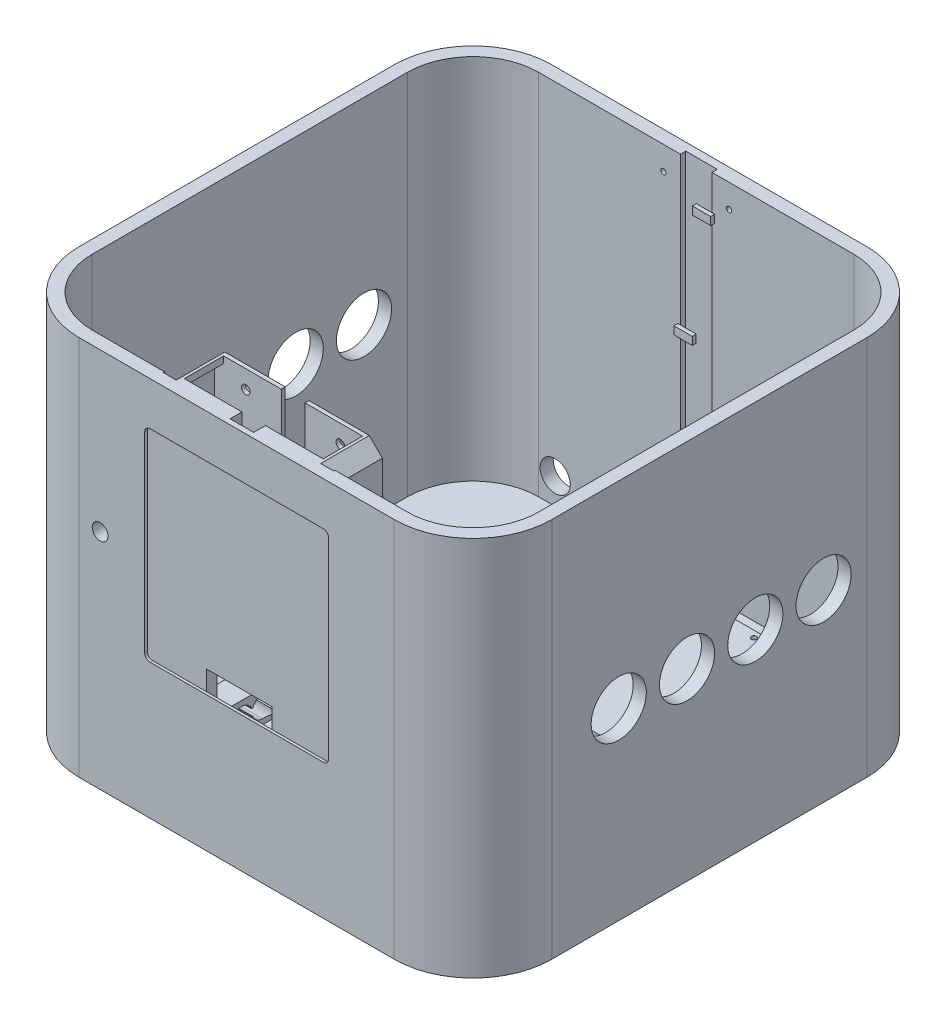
from build123d import *

# Parameters (mm, degrees)
SKETCH_1_W               = 180
SKETCH_1_H               = 180
EXTRUDE_1_DEPTH          = 180
FILLET_1_R               = 30
SHEET_EXTRUDE_1_1_BACK   = 154
SHEET_EXTRUDE_1_1_DEPTH  = 308
SHELL_2_T                = -5
SKETCH_3_W               = 13
SKETCH_3_H               = 25
EXTRUDE_2_DEPTH          = 3.5
CUT_EXTRUDE_1_REACH      = 188.634
SKETCH_4_R               = 2.75
CUT_EXTRUDE_2_DEPTH      = 4
SKETCH_7_W               = 53
SKETCH_7_H               = 63.904844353
EXTRUDE_3_DEPTH          = 2
CUT_EXTRUDE_6_DEPTH      = 2
CUT_EXTRUDE_6_DEPTH_BACK = 3
SKETCH_6_R               = 1
SKETCH_8_W               = 13
SKETCH_8_H               = 2.5
CUT_EXTRUDE_7_DEPTH      = 3.5
SKETCH_9_W               = 38
SKETCH_9_H               = 35
EXTRUDE_5_DEPTH          = 2
SKETCH_10_R              = 1
CUT_EXTRUDE_8_DEPTH      = 5
SKETCH_11_W              = 33
SKETCH_11_H              = 38
EXTRUDE_6_DEPTH          = 2
SKETCH_12_R              = 1
CUT_EXTRUDE_9_DEPTH      = 5
SKETCH_13_W              = 32
SKETCH_13_H              = 36
EXTRUDE_7_DEPTH          = 2
SKETCH_14_R              = 1
CUT_EXTRUDE_10_DEPTH     = 5
SKETCH_15_W              = 65
SKETCH_15_H              = 75
EXTRUDE_9_DEPTH          = 18
CUT_EXTRUDE_11_DEPTH     = 9.5
CUT_EXTRUDE_12_DEPTH     = 7.5
CUT_EXTRUDE_13_DEPTH     = 2.5
SKETCH_20_R              = 1.65
CUT_EXTRUDE_17_DEPTH     = 2
SKETCH_22_W              = 70
SKETCH_22_H              = 77
CUT_EXTRUDE_18_DEPTH     = 1
CUT_EXTRUDE_19_REACH     = 249.318
SKETCH_23_W              = 25
SKETCH_23_H              = 5
CUT_EXTRUDE_20_REACH     = 250.042
SKETCH_24_R              = 1
CUT_EXTRUDE_21_REACH     = 250.042
SKETCH_25_R              = 5.75
CUT_EXTRUDE_22_REACH     = 250.042
SKETCH_26_R              = 10.5
CUT_EXTRUDE_START        = -49
SKETCH_27_W              = 25
SKETCH_27_H              = 4
CUT_EXTRUDE_23_DEPTH     = 49
CUT_EXTRUDE_START_2      = -140
SKETCH_28_W              = 12
SKETCH_28_H              = 2
CUT_EXTRUDE_24_DEPTH     = 140
CUT_EXTRUDE_25_REACH     = 250.042
SKETCH_29_R              = 3
SKETCH_30_W              = 9
SKETCH_30_H              = 21
CUT_EXTRUDE_26_DEPTH     = 25
FILLET_2_R               = 2
SKETCH_31_W              = 7
SKETCH_31_H              = 3
EXTRUDE_10_DEPTH         = 1.5
SKETCH_32_W              = 8.454545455
SKETCH_32_H              = 6
SKETCH_32_W_2            = 11
SKETCH_32_H_2            = 11
SKETCH_32_W_3            = 7
SKETCH_32_H_3            = 7
EXTRUDE_11_DEPTH         = 5.5
SKETCH_33_R              = 1
CUT_EXTRUDE_27_DEPTH     = 8
SKETCH_35_W              = 5.5
SKETCH_35_H              = 5.5
CUT_EXTRUDE_28_DEPTH     = 3
SKETCH_36_W              = 7.5
SKETCH_36_H              = 12
CUT_EXTRUDE_29_DEPTH     = 2.5
SKETCH_37_W              = 10
SKETCH_37_H              = 22
EXTRUDE_12_DEPTH         = 12
CUT_EXTRUDE_30_DEPTH     = 56.5


with BuildPart() as part:
    # Sketch 1 → Extrude 1 (new body)
    with BuildSketch(Plane(origin=(0, 0, 0), x_dir=(1, 0, 0), z_dir=(0, 1, 0))):
        Rectangle(SKETCH_1_W, SKETCH_1_H)
    extrude(amount=EXTRUDE_1_DEPTH)

    # Fillet 1
    fillet_1_edges = [part.edges().sort_by_distance(p)[0] for p in [
        (90, 90, 90),
        (-90, 90, 90),
        (-90, 90, -90),
        (90, 90, -90),
    ]]
    fillet(fillet_1_edges, radius=FILLET_1_R)

    # Surface Cut 1: cut with a surface, the side behind it stays
    # Sheet Extrude 1: a surface, the sketch's curves swept straight by 308 mm
    with BuildLine(Plane(origin=(0, 0, 0), x_dir=(0, 0, -1), z_dir=(1, 0, 0)).offset(-SHEET_EXTRUDE_1_1_BACK), mode=Mode.PRIVATE) as sheet_extrude_1_1_path:
        Line((-111.469937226, 145), (109.067567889, 145))
    sheet_extrude_1_1 = Shell.extrude(sheet_extrude_1_1_path.wire(), (1 * SHEET_EXTRUDE_1_1_DEPTH, 0 * SHEET_EXTRUDE_1_1_DEPTH, 0 * SHEET_EXTRUDE_1_1_DEPTH))
    split(bisect_by=sheet_extrude_1_1, keep=Keep.BOTTOM)

    # Shell 2
    shell_2_openings = [part.faces().sort_by_distance(p)[0] for p in [
        (0, 145, 0),
    ]]
    offset(amount=SHELL_2_T, openings=shell_2_openings, kind=Kind.INTERSECTION)

    # Sketch 3 → Extrude 2 (add)
    with BuildSketch(Plane(origin=(0, 5, 0), x_dir=(1, 0, 0), z_dir=(0, 1, 0))):
        with Locations((0, 72.5)):
            Rectangle(SKETCH_3_W, SKETCH_3_H)
    extrude(amount=EXTRUDE_2_DEPTH)

    # Sketch 4 → Cut-Extrude 1 (cut, up to next)
    with BuildSketch(Plane(origin=(0, 8.5, 0), x_dir=(1, 0, 0), z_dir=(0, 1, 0)), mode=Mode.PRIVATE) as cut_extrude_1_sk1:
        with Locations(Location((0, 79.5, 0), (0, 0, 270))):
            Circle(SKETCH_4_R)
    cut_extrude_1_tool1 = extrude(cut_extrude_1_sk1.sketch, amount=-CUT_EXTRUDE_1_REACH, mode=Mode.PRIVATE) & part.part
    # Sketch 4 → Cut-Extrude 1 (cut, up to next)
    with BuildSketch(Plane(origin=(0, 8.5, 0), x_dir=(1, 0, 0), z_dir=(0, 1, 0)), mode=Mode.PRIVATE) as cut_extrude_1_sk2:
        with Locations(Location((0, 64.5, 0), (0, 0, 270))):
            Circle(SKETCH_4_R)
    cut_extrude_1_tool2 = extrude(cut_extrude_1_sk2.sketch, amount=-CUT_EXTRUDE_1_REACH, mode=Mode.PRIVATE) & part.part
    add(cut_extrude_1_tool1.solids().sort_by_distance((0, 8.5, -79.5))[0], mode=Mode.SUBTRACT)
    add(cut_extrude_1_tool2.solids().sort_by_distance((0, 8.5, -64.5))[0], mode=Mode.SUBTRACT)

    # Sketch 5 → Cut-Extrude 2 (cut)
    with BuildSketch(Plane.XZ):
        Polygon((4.330127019, -67), (4.330127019, -62), (0, -59.5), (-4.330127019, -62), (-4.330127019, -67), (0, -69.5), align=None)
        Polygon((4.330127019, -82), (4.330127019, -77), (0, -74.5), (-4.330127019, -77), (-4.330127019, -82), (0, -84.5), align=None)
    extrude(amount=-CUT_EXTRUDE_2_DEPTH, mode=Mode.SUBTRACT)

    # Sketch 7 → Extrude 3 (add)
    with BuildSketch(Plane(origin=(0, 5, 0), x_dir=(1, 0, 0), z_dir=(0, 1, 0))):
        with Locations((38, 48.047577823)):
            Rectangle(SKETCH_7_W, SKETCH_7_H)
    extrude(amount=EXTRUDE_3_DEPTH)

    # Sketch 6 → Cut-Extrude 6 (cut, two sides: drawn at the far end of the back side and taken through both)
    with BuildSketch(Plane(origin=(0, 5, 0), x_dir=(1, 0, 0), z_dir=(0, 1, 0)).offset(-CUT_EXTRUDE_6_DEPTH_BACK)):
        with Locations(Location((29.5, 77.5, 0), (0, 0, 270))):
            Circle(SKETCH_6_R)
        with Locations(Location((57, 77.5, 0), (0, 0, 270))):
            Circle(SKETCH_6_R)
        with Locations(Location((62, 25, 0), (0, 0, 270))):
            Circle(SKETCH_6_R)
    extrude(amount=CUT_EXTRUDE_6_DEPTH + CUT_EXTRUDE_6_DEPTH_BACK, mode=Mode.SUBTRACT)

    # Sketch 8 → Cut-Extrude 7 (cut)
    with BuildSketch(Plane(origin=(0, 8.5, 0), x_dir=(1, 0, 0), z_dir=(0, 1, 0))):
        with Locations((0, 83.75)):
            Rectangle(SKETCH_8_W, SKETCH_8_H)
    extrude(amount=-CUT_EXTRUDE_7_DEPTH, mode=Mode.SUBTRACT)

    # Sketch 9 → Extrude 5 (add)
    with BuildSketch(Plane(origin=(0, 5, 0), x_dir=(1, 0, 0), z_dir=(0, 1, 0))):
        with Locations((-30.5, 62.5)):
            Rectangle(SKETCH_9_W, SKETCH_9_H)
    extrude(amount=EXTRUDE_5_DEPTH)

    # Sketch 10 → Cut-Extrude 8 (cut)
    with BuildSketch(Plane(origin=(0, 7, 0), x_dir=(1, 0, 0), z_dir=(0, 1, 0))):
        with Locations(Location((-45.5, 75, 0), (0, 0, 270))):
            Circle(SKETCH_10_R)
        with Locations(Location((-15.5, 75, 0), (0, 0, 270))):
            Circle(SKETCH_10_R)
        with Locations(Location((-45.5, 50, 0), (0, 0, 270))):
            Circle(SKETCH_10_R)
        with Locations(Location((-15.5, 50, 0), (0, 0, 270))):
            Circle(SKETCH_10_R)
    extrude(amount=-CUT_EXTRUDE_8_DEPTH, mode=Mode.SUBTRACT)

    # Sketch 11 → Extrude 6 (add)
    with BuildSketch(Plane(origin=(0, 5, 0), x_dir=(1, 0, 0), z_dir=(0, 1, 0))):
        with Locations((-28, 21)):
            Rectangle(SKETCH_11_W, SKETCH_11_H)
    extrude(amount=EXTRUDE_6_DEPTH)

    # Sketch 12 → Cut-Extrude 9 (cut)
    with BuildSketch(Plane(origin=(0, 7, 0), x_dir=(1, 0, 0), z_dir=(0, 1, 0))):
        with Locations(Location((-40.5, 36, 0), (0, 0, 270))):
            Circle(SKETCH_12_R)
        with Locations(Location((-15.5, 36, 0), (0, 0, 270))):
            Circle(SKETCH_12_R)
        with Locations(Location((-15.5, 6, 0), (0, 0, 270))):
            Circle(SKETCH_12_R)
        with Locations(Location((-40.5, 6, 0), (0, 0, 270))):
            Circle(SKETCH_12_R)
    extrude(amount=-CUT_EXTRUDE_9_DEPTH, mode=Mode.SUBTRACT)

    # Sketch 13 → Extrude 7 (add)
    with BuildSketch(Plane(origin=(0, 5, 0), x_dir=(1, 0, 0), z_dir=(0, 1, 0))):
        with Locations((-65.5, 22)):
            Rectangle(SKETCH_13_W, SKETCH_13_H)
    extrude(amount=EXTRUDE_7_DEPTH)

    # Sketch 14 → Cut-Extrude 10 (cut)
    with BuildSketch(Plane(origin=(0, 7, 0), x_dir=(1, 0, 0), z_dir=(0, 1, 0))):
        with Locations(Location((-78, 36, 0), (0, 0, 270))):
            Circle(SKETCH_14_R)
        with Locations(Location((-53, 36, 0), (0, 0, 270))):
            Circle(SKETCH_14_R)
    extrude(amount=-CUT_EXTRUDE_10_DEPTH, mode=Mode.SUBTRACT)

    # Sketch 15 → Extrude 9 (add)
    with BuildSketch(Plane(origin=(0, 0, 85), x_dir=(-1, 0, 0), z_dir=(0, 0, -1))):
        with Locations((0, 107.5)):
            Rectangle(SKETCH_15_W, SKETCH_15_H)
    extrude(amount=EXTRUDE_9_DEPTH)

    # Sketch 17 → Cut-Extrude 11 (cut, symmetric)
    with BuildSketch(Plane(origin=(0, 0, 76), x_dir=(-1, 0, 0), z_dir=(0, 0, -1))):
        Polygon((-32.5, 145), (-32.5, 140), (-27.5, 145), align=None)
    cut_extrude_11 = extrude(amount=CUT_EXTRUDE_11_DEPTH, both=True, mode=Mode.SUBTRACT)

    # Mirror 1: Cut-Extrude 11 across plane
    add(cut_extrude_11.mirror(Plane(origin=(0, 0, 0), x_dir=(0, 0, 1), z_dir=(1, 0, 0))), mode=Mode.SUBTRACT)

    # Sketch 18 → Cut-Extrude 12 (cut, symmetric)
    with BuildSketch(Plane(origin=(0, 0, 76), x_dir=(-1, 0, 0), z_dir=(0, 0, -1))):
        Polygon((-30, 138.964466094), (-26.464466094, 142.5), (-26.464466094, 145.02565997), (26.464466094, 145.02565997), (26.464466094, 142.5), (30, 138.964466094), (30, 72.5), (30, 69.952762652), (-30, 69.952762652), (-30, 72.5), align=None)
    extrude(amount=CUT_EXTRUDE_12_DEPTH, both=True, mode=Mode.SUBTRACT)

    # Sketch 19 → Cut-Extrude 13 (cut)
    with BuildSketch(Plane(origin=(0, 0, 83.5), x_dir=(-1, 0, 0), z_dir=(0, 0, -1))):
        Polygon((-15.055513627, 136.4), (-15.055513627, 139.8), (-18, 141.5), (-20.944486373, 139.8), (-20.944486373, 136.4), (-18, 134.7), align=None)
        Polygon((18, 134.7), (20.944486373, 136.4), (20.944486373, 139.8), (18, 141.5), (15.055513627, 139.8), (15.055513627, 136.4), align=None)
        Polygon((2.944486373, 100.6), (2.944486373, 104), (0, 105.7), (-2.944486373, 104), (-2.944486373, 100.6), (0, 98.9), align=None)
    extrude(amount=-CUT_EXTRUDE_13_DEPTH, mode=Mode.SUBTRACT)

    # Sketch 20 → Cut-Extrude 17 (cut)
    with BuildSketch(Plane(origin=(0, 0, 67), x_dir=(-1, 0, 0), z_dir=(0, 0, -1))):
        with Locations((-18, 138.1)):
            Circle(SKETCH_20_R)
        with Locations((18, 138.1)):
            Circle(SKETCH_20_R)
        with Locations((0, 102.3)):
            Circle(SKETCH_20_R)
    extrude(amount=-CUT_EXTRUDE_17_DEPTH, mode=Mode.SUBTRACT)

    # Sketch 22 → Cut-Extrude 18 (cut)
    with BuildSketch(Plane.XY.offset(90)):
        with Locations((0, 90)):
            Rectangle(SKETCH_22_W, SKETCH_22_H)
    extrude(amount=-CUT_EXTRUDE_18_DEPTH, mode=Mode.SUBTRACT)

    # Sketch 23 → Cut-Extrude 19 (cut, up to next)
    with BuildSketch(Plane.XY.offset(89), mode=Mode.PRIVATE) as cut_extrude_19_sk1:
        with Locations((0, 56.5)):
            Rectangle(SKETCH_23_W, SKETCH_23_H)
    cut_extrude_19_tool1 = extrude(cut_extrude_19_sk1.sketch, amount=-CUT_EXTRUDE_19_REACH, mode=Mode.PRIVATE) & part.part
    add(cut_extrude_19_tool1.solids().sort_by_distance((0, 56.5, 89))[0], mode=Mode.SUBTRACT)

    # Sketch 24 → Cut-Extrude 20 (cut, up to next)
    with BuildSketch(Plane(origin=(0, 0, -90), x_dir=(-1, 0, 0), z_dir=(0, 0, -1)), mode=Mode.PRIVATE) as cut_extrude_20_sk1:
        with Locations((-12.5, 136)):
            Circle(SKETCH_24_R)
    cut_extrude_20_tool1 = extrude(cut_extrude_20_sk1.sketch, amount=-CUT_EXTRUDE_20_REACH, mode=Mode.PRIVATE) & part.part
    # Sketch 24 → Cut-Extrude 20 (cut, up to next)
    with BuildSketch(Plane(origin=(0, 0, -90), x_dir=(-1, 0, 0), z_dir=(0, 0, -1)), mode=Mode.PRIVATE) as cut_extrude_20_sk2:
        with Locations((12.5, 136)):
            Circle(SKETCH_24_R)
    cut_extrude_20_tool2 = extrude(cut_extrude_20_sk2.sketch, amount=-CUT_EXTRUDE_20_REACH, mode=Mode.PRIVATE) & part.part
    add(cut_extrude_20_tool1.solids().sort_by_distance((12.5, 136, -90))[0], mode=Mode.SUBTRACT)
    add(cut_extrude_20_tool2.solids().sort_by_distance((-12.5, 136, -90))[0], mode=Mode.SUBTRACT)

    # Sketch 25 → Cut-Extrude 21 (cut, up to next)
    with BuildSketch(Plane(origin=(0, 0, -90), x_dir=(-1, 0, 0), z_dir=(0, 0, -1)), mode=Mode.PRIVATE) as cut_extrude_21_sk1:
        with Locations((53.699478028, 15)):
            Circle(SKETCH_25_R)
    cut_extrude_21_tool1 = extrude(cut_extrude_21_sk1.sketch, amount=-CUT_EXTRUDE_21_REACH, mode=Mode.PRIVATE) & part.part
    add(cut_extrude_21_tool1.solids().sort_by_distance((-53.699478, 15, -90))[0], mode=Mode.SUBTRACT)

    # Sketch 26 → Cut-Extrude 22 (cut, up to next)
    with BuildSketch(Plane.ZY.offset(90), mode=Mode.PRIVATE) as cut_extrude_22_sk1:
        with Locations((34.503472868, 70)):
            Circle(SKETCH_26_R)
    cut_extrude_22_tool1 = extrude(cut_extrude_22_sk1.sketch, amount=-CUT_EXTRUDE_22_REACH, mode=Mode.PRIVATE) & part.part
    # Sketch 26 → Cut-Extrude 22 (cut, up to next)
    with BuildSketch(Plane.ZY.offset(90), mode=Mode.PRIVATE) as cut_extrude_22_sk2:
        with Locations((8.503472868, 70)):
            Circle(SKETCH_26_R)
    cut_extrude_22_tool2 = extrude(cut_extrude_22_sk2.sketch, amount=-CUT_EXTRUDE_22_REACH, mode=Mode.PRIVATE) & part.part
    # Sketch 26 → Cut-Extrude 22 (cut, up to next)
    with BuildSketch(Plane.ZY.offset(90), mode=Mode.PRIVATE) as cut_extrude_22_sk3:
        with Locations((-17.496527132, 70)):
            Circle(SKETCH_26_R)
    cut_extrude_22_tool3 = extrude(cut_extrude_22_sk3.sketch, amount=-CUT_EXTRUDE_22_REACH, mode=Mode.PRIVATE) & part.part
    # Sketch 26 → Cut-Extrude 22 (cut, up to next)
    with BuildSketch(Plane.ZY.offset(90), mode=Mode.PRIVATE) as cut_extrude_22_sk4:
        with Locations((-43.496527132, 70)):
            Circle(SKETCH_26_R)
    cut_extrude_22_tool4 = extrude(cut_extrude_22_sk4.sketch, amount=-CUT_EXTRUDE_22_REACH, mode=Mode.PRIVATE) & part.part
    cut_extrude_22_1 = cut_extrude_22_tool1.solids().sort_by_distance((-90, 70, 34.503473))[0]
    add(cut_extrude_22_1, mode=Mode.SUBTRACT)
    cut_extrude_22_2 = cut_extrude_22_tool2.solids().sort_by_distance((-90, 70, 8.503473))[0]
    add(cut_extrude_22_2, mode=Mode.SUBTRACT)
    cut_extrude_22_3 = cut_extrude_22_tool3.solids().sort_by_distance((-90, 70, -17.496527))[0]
    add(cut_extrude_22_3, mode=Mode.SUBTRACT)
    cut_extrude_22_4 = cut_extrude_22_tool4.solids().sort_by_distance((-90, 70, -43.496527))[0]
    add(cut_extrude_22_4, mode=Mode.SUBTRACT)
    cut_extrude_22 = cut_extrude_22_1 + cut_extrude_22_2 + cut_extrude_22_3 + cut_extrude_22_4  # Cut-Extrude 22 as one shape, for the pattern or mirror that repeats it

    # Mirror 3: Cut-Extrude 22 across plane
    add(cut_extrude_22.mirror(Plane(origin=(0, 0, 0), x_dir=(0, 0, 1), z_dir=(1, 0, 0))), mode=Mode.SUBTRACT)

    # Sketch 27 → Cut-Extrude 23 (cut)
    with BuildSketch(Plane(origin=(0, 54, 0), x_dir=(1, 0, 0), z_dir=(0, 1, 0)).offset(CUT_EXTRUDE_START)):
        with Locations((0, -87)):
            Rectangle(SKETCH_27_W, SKETCH_27_H)
    extrude(amount=CUT_EXTRUDE_23_DEPTH, mode=Mode.SUBTRACT)

    # Sketch 28 → Cut-Extrude 24 (cut)
    with BuildSketch(Plane(origin=(0, 145, 0), x_dir=(1, 0, 0), z_dir=(0, 1, 0)).offset(CUT_EXTRUDE_START_2)):
        with Locations((0, 86)):
            Rectangle(SKETCH_28_W, SKETCH_28_H)
    extrude(amount=CUT_EXTRUDE_24_DEPTH, mode=Mode.SUBTRACT)

    # Sketch 29 → Cut-Extrude 25 (cut, up to next)
    with BuildSketch(Plane.XY.offset(90), mode=Mode.PRIVATE) as cut_extrude_25_sk1:
        with Locations((-52, 85)):
            Circle(SKETCH_29_R)
    cut_extrude_25_tool1 = extrude(cut_extrude_25_sk1.sketch, amount=-CUT_EXTRUDE_25_REACH, mode=Mode.PRIVATE) & part.part
    add(cut_extrude_25_tool1.solids().sort_by_distance((-52, 85, 90))[0], mode=Mode.SUBTRACT)

    # Sketch 30 → Cut-Extrude 26 (cut)
    with BuildSketch(Plane(origin=(0, 145, 0), x_dir=(1, 0, 0), z_dir=(0, 1, 0))):
        with Locations((0, -77.5)):
            Rectangle(SKETCH_30_W, SKETCH_30_H)
    extrude(amount=-CUT_EXTRUDE_26_DEPTH, mode=Mode.SUBTRACT)

    # Fillet 2
    fillet_2_edges = [part.edges().sort_by_distance(p)[0] for p in [
        (-35, 51.5, 89.5),
        (-35, 128.5, 89.5),
        (35, 128.5, 89.5),
        (35, 51.5, 89.5),
    ]]
    fillet(fillet_2_edges, radius=FILLET_2_R)

    # Sketch 31 → Extrude 10 (add)
    with BuildSketch(Plane.XY.offset(-85)):
        with Locations((3.5, 130.196125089)):
            Rectangle(SKETCH_31_W, SKETCH_31_H)
        with Locations((-3.5, 87.173444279)):
            Rectangle(SKETCH_31_W, SKETCH_31_H)
        with Locations((3.5, 37.496245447)):
            Rectangle(SKETCH_31_W, SKETCH_31_H)
    extrude(amount=EXTRUDE_10_DEPTH)

    # Sketch 32 → Extrude 11 (add)
    # profile 1 of 3: a face of its own
    with BuildSketch(Plane(origin=(0, 0, 85), x_dir=(-1, 0, 0), z_dir=(0, 0, -1))):
        with Locations((63.272727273, 93)):
            Rectangle(SKETCH_32_W, SKETCH_32_H)
    # profile 2 of 3: a face of its own
    with BuildSketch(Plane(origin=(0, 0, 85), x_dir=(-1, 0, 0), z_dir=(0, 0, -1))):
        with Locations((63.272727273, 77)):
            Rectangle(SKETCH_32_W, SKETCH_32_H)
    # profile 3 of 3: a face of its own
    with BuildSketch(Plane(origin=(0, 0, 85), x_dir=(-1, 0, 0), z_dir=(0, 0, -1))):
        with Locations((52, 85)):
            Rectangle(SKETCH_32_W_2, SKETCH_32_H_2)
        with Locations((52, 85)):
            Rectangle(SKETCH_32_W_3, SKETCH_32_H_3, mode=Mode.SUBTRACT)
    extrude(amount=EXTRUDE_11_DEPTH)

    # Sketch 33 → Cut-Extrude 27 (cut)
    with BuildSketch(Plane(origin=(0, 0, 79.5), x_dir=(-1, 0, 0), z_dir=(0, 0, -1))):
        with Locations((64.5, 92.75)):
            Circle(SKETCH_33_R)
        with Locations((64.5, 77.25)):
            Circle(SKETCH_33_R)
    extrude(amount=-CUT_EXTRUDE_27_DEPTH, mode=Mode.SUBTRACT)

    # Sketch 35 → Cut-Extrude 28 (cut)
    with BuildSketch(Plane(origin=(0, 0, 79.5), x_dir=(-1, 0, 0), z_dir=(0, 0, -1))):
        with Locations((49.25, 87.75)):
            Rectangle(SKETCH_35_W, SKETCH_35_H)
    extrude(amount=-CUT_EXTRUDE_28_DEPTH, mode=Mode.SUBTRACT)

    # Sketch 36 → Cut-Extrude 29 (cut)
    with BuildSketch(Plane.ZY.offset(32.5)):
        with Locations((81.25, 85)):
            Rectangle(SKETCH_36_W, SKETCH_36_H)
    extrude(amount=-CUT_EXTRUDE_29_DEPTH, mode=Mode.SUBTRACT)

    # Sketch 37 → Extrude 12 (add)
    with BuildSketch(Plane(origin=(0, 5, 0), x_dir=(1, 0, 0), z_dir=(0, 1, 0))):
        with Locations((-42.405103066, -46.694833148)):
            Rectangle(SKETCH_37_W, SKETCH_37_H)
        with Locations((42.405103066, -46.694833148)):
            Rectangle(SKETCH_37_W, SKETCH_37_H)
    extrude(amount=EXTRUDE_12_DEPTH)

    # Sketch 38 → Cut-Extrude 30 (cut, symmetric)
    with BuildSketch(Plane(origin=(0, 0, 0), x_dir=(0, 0, -1), z_dir=(1, 0, 0))):
        with BuildLine():
            Line((-35.694833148, 10), (-35.694833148, 5))
            add(Edge.make_bspline(
                [(-42.694833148, 7), (-38.879872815, 7.128519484), (-35.694833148, 5)],
                knots=[0, 0, 0, 1, 1, 1], degree=2))
            ThreePointArc((-42.694833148, 7), (-44.961411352, 7.704150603), (-46.429983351, 9.568688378))
            Line((-46.429983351, 9.568688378), (-46.913969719, 9.694216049))
            ThreePointArc((-46.913969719, 9.694216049), (-54.694571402, 10.954240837), (-46.944833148, 12.391941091))
            Line((-46.944833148, 12.391941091), (-46.444833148, 12.391941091))
            ThreePointArc((-46.444833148, 12.391941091), (-41.987726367, 14.937003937), (-38.694833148, 11))
            add(Edge.make_bspline(
                [(-38.694833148, 11), (-37.751199, 10.084864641), (-35.694833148, 10)],
                knots=[0.636809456, 0.636809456, 0.636809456, 1, 1, 1], degree=2))
        make_face()
    extrude(amount=CUT_EXTRUDE_30_DEPTH, both=True, mode=Mode.SUBTRACT)


solid = part.part
